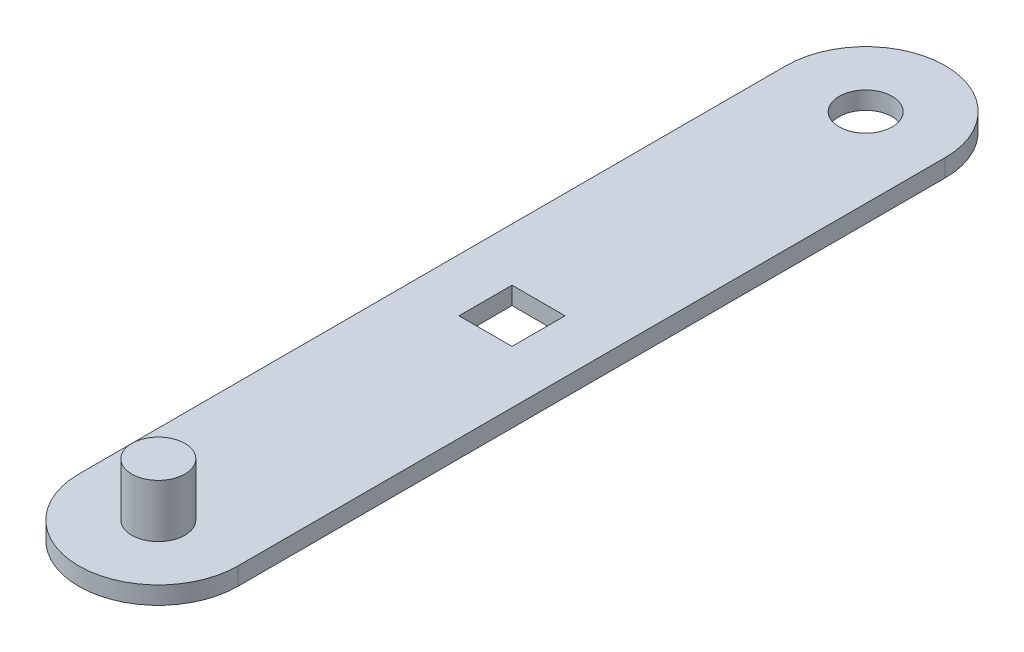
from build123d import *

# Parameters (mm, degrees)
SKETCH1_W           = 450
SKETCH1_H           = 2000
BOSS_EXTRUDE1_DEPTH = 50
BOSS_EXTRUDE2_DEPTH = 150
CUT_EXTRUDE2_DEPTH  = 250
SKETCH5_W           = 150
SKETCH5_H           = 150
CUT_EXTRUDE3_DEPTH  = 1255.491929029


with BuildPart() as part:
    # Sketch1 → Boss-Extrude1 (new body)
    with BuildSketch(Plane(origin=(0, 0, 0), x_dir=(1, 0, 0), z_dir=(0, 1, 0))):
        Rectangle(SKETCH1_W, SKETCH1_H)
        with BuildLine():
            Line((-225, 1000), (225, 1000))
            ThreePointArc((225, 1000), (0, 1225), (-225, 1000))
        make_face()
        with BuildLine():
            ThreePointArc((225, -1000), (0, -1225), (-225, -1000))
            Line((-225, -1000), (225, -1000))
        make_face()
    extrude(amount=BOSS_EXTRUDE1_DEPTH)

    # Sketch2 → Boss-Extrude2 (add)
    with BuildSketch(Plane(origin=(0, 50, 0), x_dir=(1, 0, 0), z_dir=(0, 1, 0))):
        with BuildLine():
            ThreePointArc((75, -1000), (0, -925), (-75, -1000))
            Line((-75, -1000), (75, -1000))
        make_face()
        with BuildLine():
            Line((75, -1000), (-75, -1000))
            ThreePointArc((-75, -1000), (0, -1075), (75, -1000))
        make_face()
        with BuildLine():
            ThreePointArc((75, -1000), (0, -925), (-75, -1000))
            Line((-75, -1000), (75, -1000))
        make_face()
        with BuildLine():
            Line((75, -1000), (-75, -1000))
            ThreePointArc((-75, -1000), (0, -1075), (75, -1000))
        make_face()
    extrude(amount=BOSS_EXTRUDE2_DEPTH)

    # Sketch3 → Cut-Extrude2 (cut)
    with BuildSketch(Plane(origin=(0, 50, 0), x_dir=(1, 0, 0), z_dir=(0, 1, 0))):
        with BuildLine():
            ThreePointArc((75, 1000), (0, 1075), (-75, 1000))
            Line((-75, 1000), (75, 1000))
        make_face()
        with BuildLine():
            Line((75, 1000), (-75, 1000))
            ThreePointArc((-75, 1000), (0, 925), (75, 1000))
        make_face()
        with BuildLine():
            ThreePointArc((75, 1000), (0, 1075), (-75, 1000))
            Line((-75, 1000), (75, 1000))
        make_face()
        with BuildLine():
            Line((75, 1000), (-75, 1000))
            ThreePointArc((-75, 1000), (0, 925), (75, 1000))
        make_face()
    extrude(amount=-CUT_EXTRUDE2_DEPTH, mode=Mode.SUBTRACT)

    # Sketch5 → Cut-Extrude3 (cut, through all)
    with BuildSketch(Plane(origin=(0, 50, 0), x_dir=(1, 0, 0), z_dir=(0, 1, 0))):
        Rectangle(SKETCH5_W, SKETCH5_H)
    extrude(amount=-CUT_EXTRUDE3_DEPTH, mode=Mode.SUBTRACT)


solid = part.part
